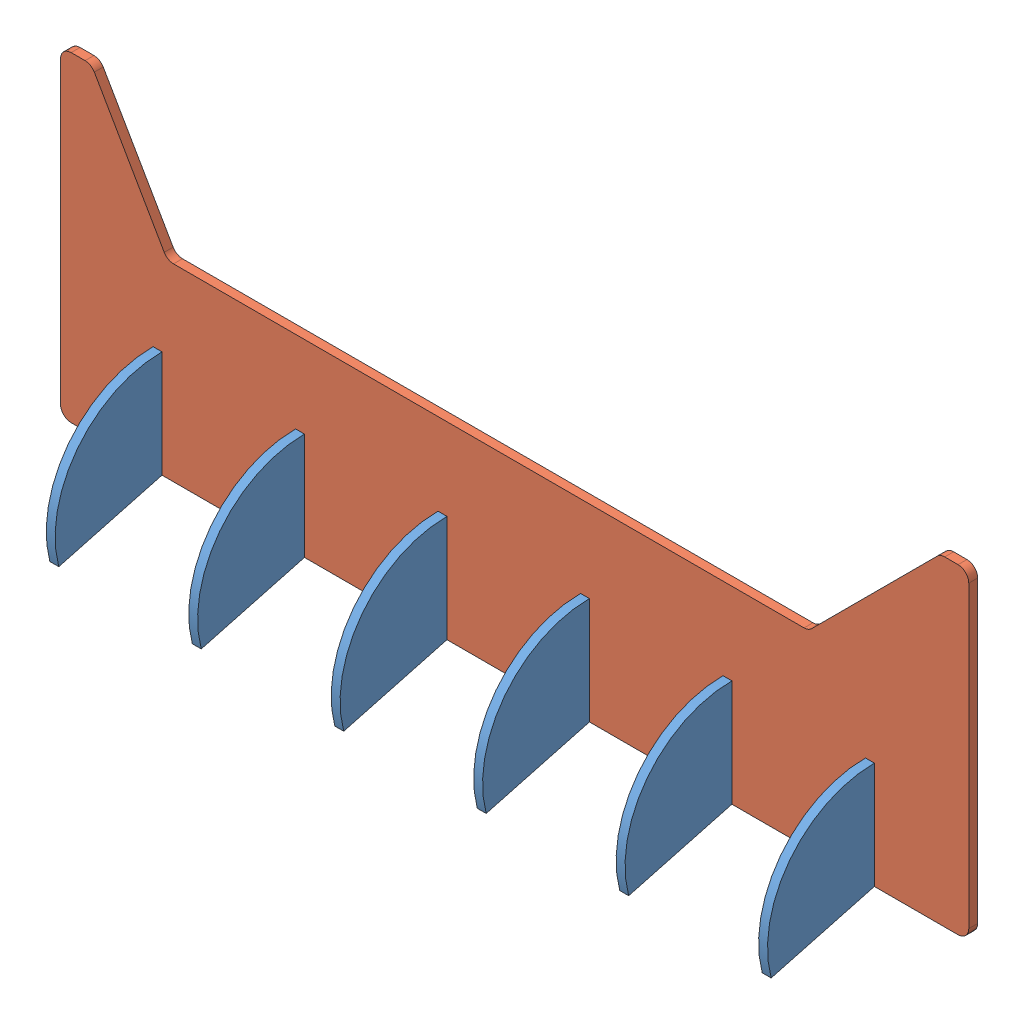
SolidWorks assembly 装配体1.sldasm, configuration Default (file format 10000). Lengths in mm.
Overall size (255 97.76 32.5).
7 component instances, 2 part files, 3 mates.
Components (placement in the parent):
- 板1支撑-2: 板1支撑.SLDPRT [Default] at (-48.5023 32.7625 -18.9223) x (0 0 1) z (-1 0 0) size (32.5 37.76 2.5)
- 离主控灯柱最近的板-2: 离主控灯柱最近的板.SLDPRT [Default] at (29.0142 77.9273 -21.4223) size (255 90 2.5)
- 板1支撑-3: 板1支撑.SLDPRT [Default] at (-8.5023 32.7625 -18.9223) x (0 0 1) z (-1 0 0) size (32.5 37.76 2.5)
- 板1支撑-4: 板1支撑.SLDPRT [Default] at (31.4977 32.7625 -18.9223) x (0 0 1) z (-1 0 0) size (32.5 37.76 2.5)
- 板1支撑-5: 板1支撑.SLDPRT [Default] at (71.4977 32.7625 -18.9223) x (0 0 1) z (-1 0 0) size (32.5 37.76 2.5)
- 板1支撑-6: 板1支撑.SLDPRT [Default] at (111.4977 32.7625 -18.9223) x (0 0 1) z (-1 0 0) size (32.5 37.76 2.5)
- 板1支撑-7: 板1支撑.SLDPRT [Default] at (151.4977 32.7625 -18.9223) x (0 0 1) z (-1 0 0) size (32.5 37.76 2.5)
Mates (geometry in assembly coordinates):
- 重合6: coincident anti-aligned: plane of 板1支撑-2 through (-51.0023 32.7625 -18.9223) normal (-1 0 0); plane of 离主控灯柱最近的板-2 through (-51.0023 44.7625 -18.9223) normal (1 0 0)
- 重合7: coincident anti-aligned: plane of 板1支撑-2 through (-51.0023 44.7625 -21.4223) normal (0 1 0); plane of 离主控灯柱最近的板-2 through (-51.0023 44.7625 -18.9223) normal (0 -1 0)
- 重合8: coincident aligned: plane of 板1支撑-2 through (-51.0023 38.7625 -21.4223) normal (0 0 -1); plane of 离主控灯柱最近的板-2 through (29.0142 77.9273 -21.4223) normal (0 0 -1)
